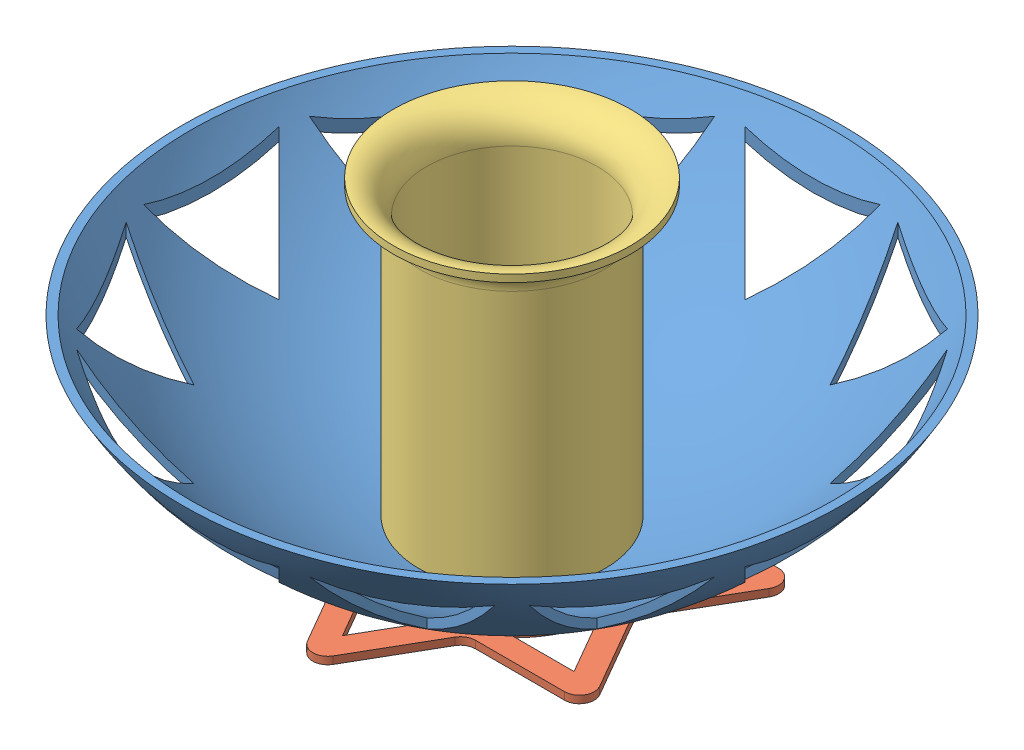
SolidWorks assembly Assem2.SLDASM, configuration Default (file format 4100). Lengths in mm.
Overall size (88.9 43.1 88.9).
3 component instances, 3 part files, 3 mates.
Components (placement in the parent):
- CutBowl-1: CutBowl.SLDPRT [Default] at origin size (88.9 26 88.9)
- Starbase-1: Starbase.SLDPRT [Default] at (-62.9015 -52 -69.5215) size (47.07 1 53.74)
- FlareCH-1: FlareCH.SLDPRT [Default] at (0 -48.3681 0) x (0.995264 0 -0.097208) z (0.097208 0 0.995264) size (31.94 39.47 31.94)
Mates (geometry in assembly coordinates):
- Concentric1: concentric anti-aligned: cylinder of CutBowl-1 through (0 -51 0) axis (0 1 0) radius 0.0005; cylinder of Starbase-1 through (0 -51 0) axis (0 -1 0) radius 15.1221
- Tangent1: tangent anti-aligned: sphere of CutBowl-1; plane of Starbase-1 through (-9.488 -51 -16.4338) normal (0 1 0)
- Concentric2: concentric anti-aligned: cylinder of CutBowl-1 through (0 -51 0) axis (0 1 0) radius 0.0005; cylinder of FlareCH-1 through (0 -13.3681 0) axis (0 -1 0) radius 12.5
